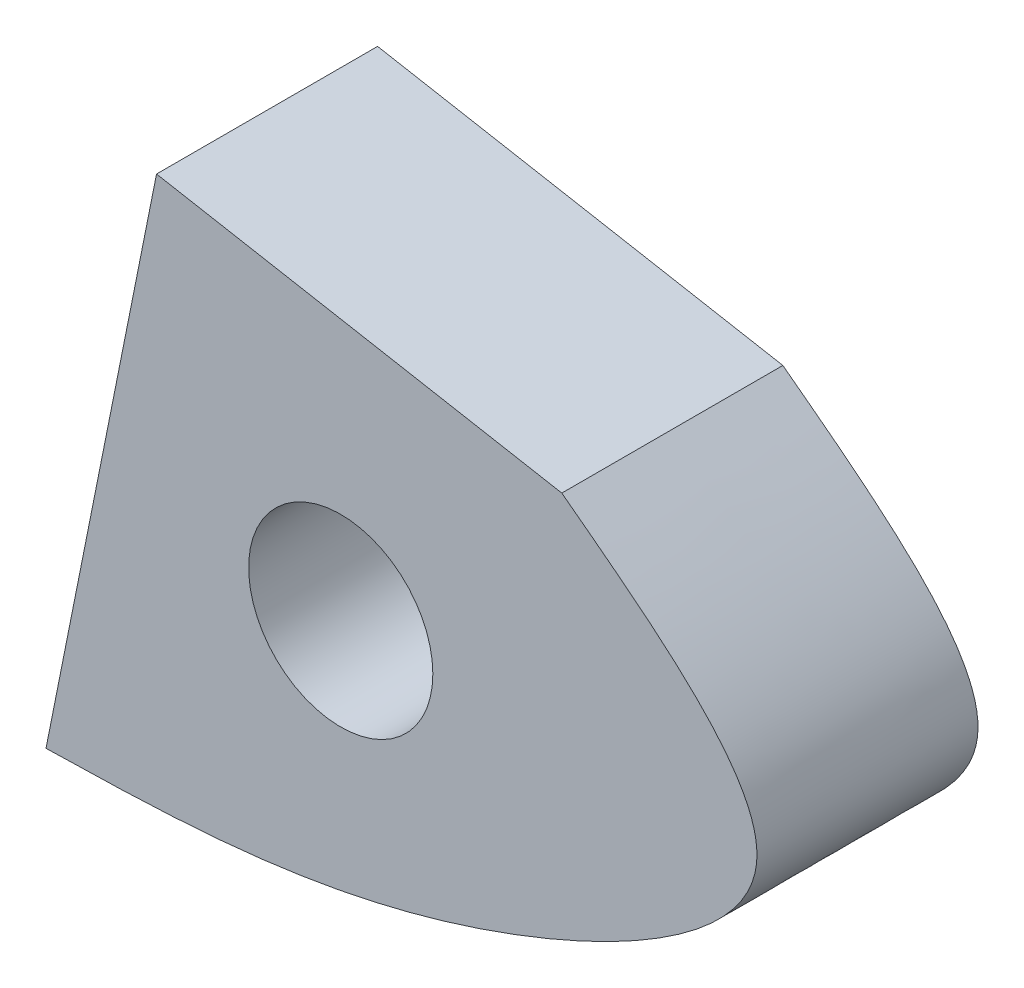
ISO-10303-21;
HEADER;
FILE_DESCRIPTION(('STEP AP214'),'2;1');
FILE_NAME('part.step','',(''),(''),'','','');
FILE_SCHEMA(('AUTOMOTIVE_DESIGN { 1 0 10303 214 1 1 1 1 }'));
ENDSEC;
DATA;
#1=APPLICATION_CONTEXT('core data for automotive mechanical design processes');
#2=APPLICATION_PROTOCOL_DEFINITION('international standard','automotive_design',2000,#1);
#3=PRODUCT_CONTEXT('',#1,'mechanical');
#4=PRODUCT('Part','Part','',(#3));
#5=PRODUCT_RELATED_PRODUCT_CATEGORY('part','',(#4));
#6=PRODUCT_DEFINITION_FORMATION('','',#4);
#7=PRODUCT_DEFINITION_CONTEXT('part definition',#1,'design');
#8=PRODUCT_DEFINITION('design','',#6,#7);
#9=PRODUCT_DEFINITION_SHAPE('','',#8);
#10=(LENGTH_UNIT() NAMED_UNIT(*) SI_UNIT(.MILLI.,.METRE.));
#11=(NAMED_UNIT(*) PLANE_ANGLE_UNIT() SI_UNIT($,.RADIAN.));
#12=(NAMED_UNIT(*) SI_UNIT($,.STERADIAN.) SOLID_ANGLE_UNIT());
#13=UNCERTAINTY_MEASURE_WITH_UNIT(LENGTH_MEASURE(1.E-05),#10,'distance_accuracy_value','');
#14=(GEOMETRIC_REPRESENTATION_CONTEXT(3) GLOBAL_UNCERTAINTY_ASSIGNED_CONTEXT((#13)) GLOBAL_UNIT_ASSIGNED_CONTEXT((#10,
#11,#12)) REPRESENTATION_CONTEXT('',''));
#15=CARTESIAN_POINT('',(0.,0.,0.));
#16=DIRECTION('',(0.,0.,1.));
#17=DIRECTION('',(1.,0.,0.));
#18=AXIS2_PLACEMENT_3D('',#15,#16,#17);
#19=CARTESIAN_POINT('',(33.6915853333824,-20.8415233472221,30.));
#20=DIRECTION('',(0.,0.,-1.));
#21=DIRECTION('',(-1.,0.,0.));
#22=AXIS2_PLACEMENT_3D('',#19,#20,#21);
#23=PLANE('',#22);
#24=DIRECTION('',(-0.196116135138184,-0.98058067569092,0.));
#25=VECTOR('',#24,1.);
#26=CARTESIAN_POINT('',(-25.,40.,30.));
#27=LINE('',#26,#25);
#28=CARTESIAN_POINT('',(-25.,40.,30.));
#29=VERTEX_POINT('',#28);
#30=CARTESIAN_POINT('',(-40.,-35.,30.));
#31=VERTEX_POINT('',#30);
#32=EDGE_CURVE('E93',#29,#31,#27,.T.);
#33=ORIENTED_EDGE('',*,*,#32,.T.);
#34=CARTESIAN_POINT('',(-40.,-35.,30.));
#35=CARTESIAN_POINT('',(-21.2896269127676,-34.5880091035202,30.));
#36=CARTESIAN_POINT('',(11.3108770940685,-33.8701660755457,30.));
#37=CARTESIAN_POINT('',(72.4519445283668,-1.96916445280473,30.));
#38=CARTESIAN_POINT('',(43.5846222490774,19.7698673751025,30.));
#39=CARTESIAN_POINT('',(30.,30.,30.));
#40=B_SPLINE_CURVE_WITH_KNOTS('',3,(#34,#35,#36,#37,#38,#39),.UNSPECIFIED.,.F.,.F.,(4,1,1,4),
(0.,0.416273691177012,0.725305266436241,1.),.UNSPECIFIED.);
#41=CARTESIAN_POINT('',(30.,30.,30.));
#42=VERTEX_POINT('',#41);
#43=EDGE_CURVE('E50',#31,#42,#40,.T.);
#44=ORIENTED_EDGE('',*,*,#43,.T.);
#45=DIRECTION('',(-0.983869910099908,0.178885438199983,0.));
#46=VECTOR('',#45,1.);
#47=CARTESIAN_POINT('',(-25.,40.,30.));
#48=LINE('',#47,#46);
#49=EDGE_CURVE('E46',#42,#29,#48,.T.);
#50=ORIENTED_EDGE('',*,*,#49,.T.);
#51=EDGE_LOOP('',(#33,#44,#50));
#52=FACE_BOUND('',#51,.T.);
#53=CARTESIAN_POINT('',(0.,0.,30.));
#54=DIRECTION('',(0.,0.,1.));
#55=DIRECTION('',(1.,0.,0.));
#56=AXIS2_PLACEMENT_3D('',#53,#54,#55);
#57=CIRCLE('',#56,12.5);
#58=CARTESIAN_POINT('',(12.5,0.,30.));
#59=VERTEX_POINT('',#58);
#60=EDGE_CURVE('E80',#59,#59,#57,.T.);
#61=ORIENTED_EDGE('',*,*,#60,.F.);
#62=EDGE_LOOP('',(#61));
#63=FACE_BOUND('',#62,.T.);
#64=ADVANCED_FACE('F31',(#52,#63),#23,.F.);
#65=CARTESIAN_POINT('',(33.6915853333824,-20.8415233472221,0.));
#66=DIRECTION('',(0.,0.,-1.));
#67=DIRECTION('',(-1.,0.,0.));
#68=AXIS2_PLACEMENT_3D('',#65,#66,#67);
#69=PLANE('',#68);
#70=DIRECTION('',(-0.196116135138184,-0.98058067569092,0.));
#71=VECTOR('',#70,1.);
#72=CARTESIAN_POINT('',(-25.,40.,0.));
#73=LINE('',#72,#71);
#74=CARTESIAN_POINT('',(-25.,40.,0.));
#75=VERTEX_POINT('',#74);
#76=CARTESIAN_POINT('',(-40.,-35.,0.));
#77=VERTEX_POINT('',#76);
#78=EDGE_CURVE('E69',#75,#77,#73,.T.);
#79=ORIENTED_EDGE('',*,*,#78,.F.);
#80=DIRECTION('',(-0.983869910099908,0.178885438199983,0.));
#81=VECTOR('',#80,1.);
#82=CARTESIAN_POINT('',(-25.,40.,0.));
#83=LINE('',#82,#81);
#84=CARTESIAN_POINT('',(30.,30.,0.));
#85=VERTEX_POINT('',#84);
#86=EDGE_CURVE('E70',#85,#75,#83,.T.);
#87=ORIENTED_EDGE('',*,*,#86,.F.);
#88=CARTESIAN_POINT('',(-40.,-35.,0.));
#89=CARTESIAN_POINT('',(-21.2896269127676,-34.5880091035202,0.));
#90=CARTESIAN_POINT('',(11.3108770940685,-33.8701660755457,0.));
#91=CARTESIAN_POINT('',(72.4519445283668,-1.96916445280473,0.));
#92=CARTESIAN_POINT('',(43.5846222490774,19.7698673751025,0.));
#93=CARTESIAN_POINT('',(30.,30.,0.));
#94=B_SPLINE_CURVE_WITH_KNOTS('',3,(#88,#89,#90,#91,#92,#93),.UNSPECIFIED.,.F.,.F.,(4,1,1,4),
(0.,0.416273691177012,0.725305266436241,1.),.UNSPECIFIED.);
#95=EDGE_CURVE('E65',#77,#85,#94,.T.);
#96=ORIENTED_EDGE('',*,*,#95,.F.);
#97=EDGE_LOOP('',(#79,#87,#96));
#98=FACE_BOUND('',#97,.T.);
#99=CARTESIAN_POINT('',(0.,0.,0.));
#100=DIRECTION('',(0.,0.,1.));
#101=DIRECTION('',(1.,0.,0.));
#102=AXIS2_PLACEMENT_3D('',#99,#100,#101);
#103=CIRCLE('',#102,12.5);
#104=CARTESIAN_POINT('',(12.5,0.,0.));
#105=VERTEX_POINT('',#104);
#106=EDGE_CURVE('E83',#105,#105,#103,.T.);
#107=ORIENTED_EDGE('',*,*,#106,.T.);
#108=EDGE_LOOP('',(#107));
#109=FACE_BOUND('',#108,.T.);
#110=ADVANCED_FACE('F66',(#98,#109),#69,.T.);
#111=CARTESIAN_POINT('',(-25.,40.,30.));
#112=DIRECTION('',(0.98058067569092,-0.196116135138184,0.));
#113=DIRECTION('',(0.196116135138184,0.98058067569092,0.));
#114=AXIS2_PLACEMENT_3D('',#111,#112,#113);
#115=PLANE('',#114);
#116=ORIENTED_EDGE('',*,*,#78,.T.);
#117=DIRECTION('',(0.,0.,-1.));
#118=VECTOR('',#117,1.);
#119=CARTESIAN_POINT('',(-40.,-35.,30.));
#120=LINE('',#119,#118);
#121=EDGE_CURVE('E11',#31,#77,#120,.T.);
#122=ORIENTED_EDGE('',*,*,#121,.F.);
#123=ORIENTED_EDGE('',*,*,#32,.F.);
#124=DIRECTION('',(0.,0.,-1.));
#125=VECTOR('',#124,1.);
#126=CARTESIAN_POINT('',(-25.,40.,30.));
#127=LINE('',#126,#125);
#128=EDGE_CURVE('E79',#29,#75,#127,.T.);
#129=ORIENTED_EDGE('',*,*,#128,.T.);
#130=EDGE_LOOP('',(#116,#122,#123,#129));
#131=FACE_BOUND('',#130,.T.);
#132=ADVANCED_FACE('F33',(#131),#115,.F.);
#133=DIRECTION('',(0.,0.,-1.));
#134=VECTOR('',#133,1.);
#135=SURFACE_OF_LINEAR_EXTRUSION('',#40,#134);
#136=ORIENTED_EDGE('',*,*,#95,.T.);
#137=DIRECTION('',(0.,0.,-1.));
#138=VECTOR('',#137,1.);
#139=CARTESIAN_POINT('',(30.,30.,30.));
#140=LINE('',#139,#138);
#141=EDGE_CURVE('E39',#42,#85,#140,.T.);
#142=ORIENTED_EDGE('',*,*,#141,.F.);
#143=ORIENTED_EDGE('',*,*,#43,.F.);
#144=ORIENTED_EDGE('',*,*,#121,.T.);
#145=EDGE_LOOP('',(#136,#142,#143,#144));
#146=FACE_BOUND('',#145,.T.);
#147=ADVANCED_FACE('F75',(#146),#135,.F.);
#148=CARTESIAN_POINT('',(-25.,40.,30.));
#149=DIRECTION('',(-0.178885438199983,-0.983869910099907,0.));
#150=DIRECTION('',(0.983869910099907,-0.178885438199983,0.));
#151=AXIS2_PLACEMENT_3D('',#148,#149,#150);
#152=PLANE('',#151);
#153=ORIENTED_EDGE('',*,*,#86,.T.);
#154=ORIENTED_EDGE('',*,*,#128,.F.);
#155=ORIENTED_EDGE('',*,*,#49,.F.);
#156=ORIENTED_EDGE('',*,*,#141,.T.);
#157=EDGE_LOOP('',(#153,#154,#155,#156));
#158=FACE_BOUND('',#157,.T.);
#159=ADVANCED_FACE('F105',(#158),#152,.F.);
#160=CARTESIAN_POINT('',(0.,0.,30.));
#161=DIRECTION('',(0.,0.,-1.));
#162=DIRECTION('',(-1.,0.,0.));
#163=AXIS2_PLACEMENT_3D('',#160,#161,#162);
#164=CYLINDRICAL_SURFACE('',#163,12.5);
#165=ORIENTED_EDGE('',*,*,#60,.T.);
#166=EDGE_LOOP('',(#165));
#167=FACE_BOUND('',#166,.T.);
#168=ORIENTED_EDGE('',*,*,#106,.F.);
#169=EDGE_LOOP('',(#168));
#170=FACE_BOUND('',#169,.T.);
#171=ADVANCED_FACE('F108',(#167,#170),#164,.F.);
#172=CLOSED_SHELL('',(#64,#110,#132,#147,#159,#171));
#173=MANIFOLD_SOLID_BREP('B2',#172);
#174=ADVANCED_BREP_SHAPE_REPRESENTATION('',(#18,#173),#14);
#175=SHAPE_DEFINITION_REPRESENTATION(#9,#174);
ENDSEC;
END-ISO-10303-21;
